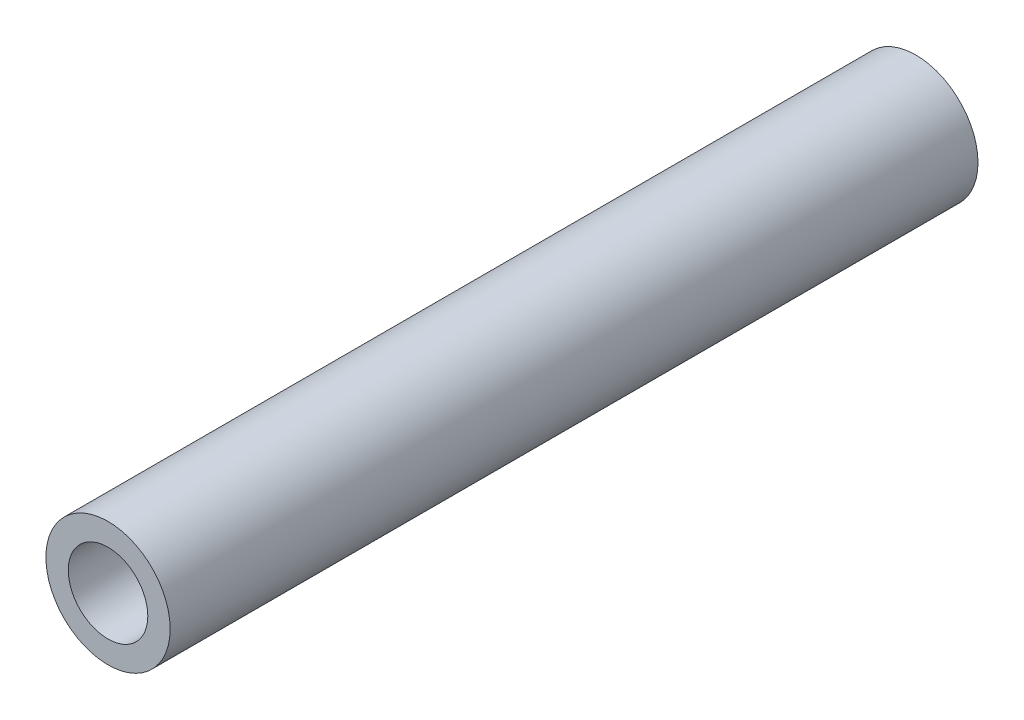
ISO-10303-21;
HEADER;
FILE_DESCRIPTION(('STEP AP214'),'2;1');
FILE_NAME('part.step','',(''),(''),'','','');
FILE_SCHEMA(('AUTOMOTIVE_DESIGN { 1 0 10303 214 1 1 1 1 }'));
ENDSEC;
DATA;
#1=APPLICATION_CONTEXT('core data for automotive mechanical design processes');
#2=APPLICATION_PROTOCOL_DEFINITION('international standard','automotive_design',2000,#1);
#3=PRODUCT_CONTEXT('',#1,'mechanical');
#4=PRODUCT('Part','Part','',(#3));
#5=PRODUCT_RELATED_PRODUCT_CATEGORY('part','',(#4));
#6=PRODUCT_DEFINITION_FORMATION('','',#4);
#7=PRODUCT_DEFINITION_CONTEXT('part definition',#1,'design');
#8=PRODUCT_DEFINITION('design','',#6,#7);
#9=PRODUCT_DEFINITION_SHAPE('','',#8);
#10=(LENGTH_UNIT() NAMED_UNIT(*) SI_UNIT(.MILLI.,.METRE.));
#11=(NAMED_UNIT(*) PLANE_ANGLE_UNIT() SI_UNIT($,.RADIAN.));
#12=(NAMED_UNIT(*) SI_UNIT($,.STERADIAN.) SOLID_ANGLE_UNIT());
#13=UNCERTAINTY_MEASURE_WITH_UNIT(LENGTH_MEASURE(1.E-05),#10,'distance_accuracy_value','');
#14=(GEOMETRIC_REPRESENTATION_CONTEXT(3) GLOBAL_UNCERTAINTY_ASSIGNED_CONTEXT((#13)) GLOBAL_UNIT_ASSIGNED_CONTEXT((#10,
#11,#12)) REPRESENTATION_CONTEXT('',''));
#15=CARTESIAN_POINT('',(0.,0.,0.));
#16=DIRECTION('',(0.,0.,1.));
#17=DIRECTION('',(1.,0.,0.));
#18=AXIS2_PLACEMENT_3D('',#15,#16,#17);
#19=CARTESIAN_POINT('',(0.,0.,32.5));
#20=DIRECTION('',(0.,0.,-1.));
#21=DIRECTION('',(-1.,0.,0.));
#22=AXIS2_PLACEMENT_3D('',#19,#20,#21);
#23=CYLINDRICAL_SURFACE('',#22,2.5);
#24=CARTESIAN_POINT('',(0.,0.,32.5));
#25=DIRECTION('',(0.,0.,1.));
#26=DIRECTION('',(1.,0.,0.));
#27=AXIS2_PLACEMENT_3D('',#24,#25,#26);
#28=CIRCLE('',#27,2.5);
#29=CARTESIAN_POINT('',(2.5,0.,32.5));
#30=VERTEX_POINT('',#29);
#31=EDGE_CURVE('E10',#30,#30,#28,.T.);
#32=ORIENTED_EDGE('',*,*,#31,.F.);
#33=EDGE_LOOP('',(#32));
#34=FACE_BOUND('',#33,.T.);
#35=CARTESIAN_POINT('',(0.,0.,0.));
#36=DIRECTION('',(0.,0.,1.));
#37=DIRECTION('',(1.,0.,0.));
#38=AXIS2_PLACEMENT_3D('',#35,#36,#37);
#39=CIRCLE('',#38,2.5);
#40=CARTESIAN_POINT('',(2.5,0.,0.));
#41=VERTEX_POINT('',#40);
#42=EDGE_CURVE('E34',#41,#41,#39,.T.);
#43=ORIENTED_EDGE('',*,*,#42,.T.);
#44=EDGE_LOOP('',(#43));
#45=FACE_BOUND('',#44,.T.);
#46=ADVANCED_FACE('F31',(#34,#45),#23,.T.);
#47=CARTESIAN_POINT('',(0.,0.,32.5));
#48=DIRECTION('',(0.,0.,1.));
#49=DIRECTION('',(1.,0.,0.));
#50=AXIS2_PLACEMENT_3D('',#47,#48,#49);
#51=PLANE('',#50);
#52=CARTESIAN_POINT('',(0.,0.,32.5));
#53=DIRECTION('',(0.,0.,1.));
#54=DIRECTION('',(1.,0.,0.));
#55=AXIS2_PLACEMENT_3D('',#52,#53,#54);
#56=CIRCLE('',#55,1.6);
#57=CARTESIAN_POINT('',(1.6,0.,32.5));
#58=VERTEX_POINT('',#57);
#59=EDGE_CURVE('E49',#58,#58,#56,.T.);
#60=ORIENTED_EDGE('',*,*,#59,.F.);
#61=EDGE_LOOP('',(#60));
#62=FACE_BOUND('',#61,.T.);
#63=ORIENTED_EDGE('',*,*,#31,.T.);
#64=EDGE_LOOP('',(#63));
#65=FACE_BOUND('',#64,.T.);
#66=ADVANCED_FACE('F64',(#62,#65),#51,.T.);
#67=CARTESIAN_POINT('',(0.,0.,0.));
#68=DIRECTION('',(0.,0.,1.));
#69=DIRECTION('',(1.,0.,0.));
#70=AXIS2_PLACEMENT_3D('',#67,#68,#69);
#71=PLANE('',#70);
#72=CARTESIAN_POINT('',(0.,0.,0.));
#73=DIRECTION('',(0.,0.,-1.));
#74=DIRECTION('',(-1.,0.,0.));
#75=AXIS2_PLACEMENT_3D('',#72,#73,#74);
#76=CIRCLE('',#75,1.25);
#77=CARTESIAN_POINT('',(-1.25,0.,0.));
#78=VERTEX_POINT('',#77);
#79=EDGE_CURVE('E43',#78,#78,#76,.T.);
#80=ORIENTED_EDGE('',*,*,#79,.F.);
#81=EDGE_LOOP('',(#80));
#82=FACE_BOUND('',#81,.T.);
#83=ORIENTED_EDGE('',*,*,#42,.F.);
#84=EDGE_LOOP('',(#83));
#85=FACE_BOUND('',#84,.T.);
#86=ADVANCED_FACE('F66',(#82,#85),#71,.F.);
#87=CARTESIAN_POINT('',(0.,0.,8.));
#88=DIRECTION('',(0.,0.,-1.));
#89=DIRECTION('',(-1.,0.,0.));
#90=AXIS2_PLACEMENT_3D('',#87,#88,#89);
#91=CYLINDRICAL_SURFACE('',#90,1.25);
#92=CARTESIAN_POINT('',(0.,0.,8.));
#93=DIRECTION('',(0.,0.,-1.));
#94=DIRECTION('',(-1.,0.,0.));
#95=AXIS2_PLACEMENT_3D('',#92,#93,#94);
#96=CIRCLE('',#95,1.25);
#97=CARTESIAN_POINT('',(-1.25,0.,8.));
#98=VERTEX_POINT('',#97);
#99=EDGE_CURVE('E41',#98,#98,#96,.T.);
#100=ORIENTED_EDGE('',*,*,#99,.F.);
#101=EDGE_LOOP('',(#100));
#102=FACE_BOUND('',#101,.T.);
#103=ORIENTED_EDGE('',*,*,#79,.T.);
#104=EDGE_LOOP('',(#103));
#105=FACE_BOUND('',#104,.T.);
#106=ADVANCED_FACE('F72',(#102,#105),#91,.F.);
#107=CARTESIAN_POINT('',(0.,0.,8.));
#108=DIRECTION('',(0.,0.,-1.));
#109=DIRECTION('',(-1.,0.,0.));
#110=AXIS2_PLACEMENT_3D('',#107,#108,#109);
#111=PLANE('',#110);
#112=ORIENTED_EDGE('',*,*,#99,.T.);
#113=EDGE_LOOP('',(#112));
#114=FACE_BOUND('',#113,.T.);
#115=ADVANCED_FACE('F60',(#114),#111,.T.);
#116=CARTESIAN_POINT('',(0.,0.,24.5));
#117=DIRECTION('',(0.,0.,1.));
#118=DIRECTION('',(1.,0.,0.));
#119=AXIS2_PLACEMENT_3D('',#116,#117,#118);
#120=CYLINDRICAL_SURFACE('',#119,1.6);
#121=CARTESIAN_POINT('',(0.,0.,24.5));
#122=DIRECTION('',(0.,0.,1.));
#123=DIRECTION('',(1.,0.,0.));
#124=AXIS2_PLACEMENT_3D('',#121,#122,#123);
#125=CIRCLE('',#124,1.6);
#126=CARTESIAN_POINT('',(1.6,0.,24.5));
#127=VERTEX_POINT('',#126);
#128=EDGE_CURVE('E46',#127,#127,#125,.T.);
#129=ORIENTED_EDGE('',*,*,#128,.F.);
#130=EDGE_LOOP('',(#129));
#131=FACE_BOUND('',#130,.T.);
#132=ORIENTED_EDGE('',*,*,#59,.T.);
#133=EDGE_LOOP('',(#132));
#134=FACE_BOUND('',#133,.T.);
#135=ADVANCED_FACE('F57',(#131,#134),#120,.F.);
#136=CARTESIAN_POINT('',(0.,0.,24.5));
#137=DIRECTION('',(0.,0.,1.));
#138=DIRECTION('',(1.,0.,0.));
#139=AXIS2_PLACEMENT_3D('',#136,#137,#138);
#140=PLANE('',#139);
#141=ORIENTED_EDGE('',*,*,#128,.T.);
#142=EDGE_LOOP('',(#141));
#143=FACE_BOUND('',#142,.T.);
#144=ADVANCED_FACE('F55',(#143),#140,.T.);
#145=CLOSED_SHELL('',(#46,#66,#86,#106,#115,#135,#144));
#146=MANIFOLD_SOLID_BREP('B2',#145);
#147=ADVANCED_BREP_SHAPE_REPRESENTATION('',(#18,#146),#14);
#148=SHAPE_DEFINITION_REPRESENTATION(#9,#147);
ENDSEC;
END-ISO-10303-21;
